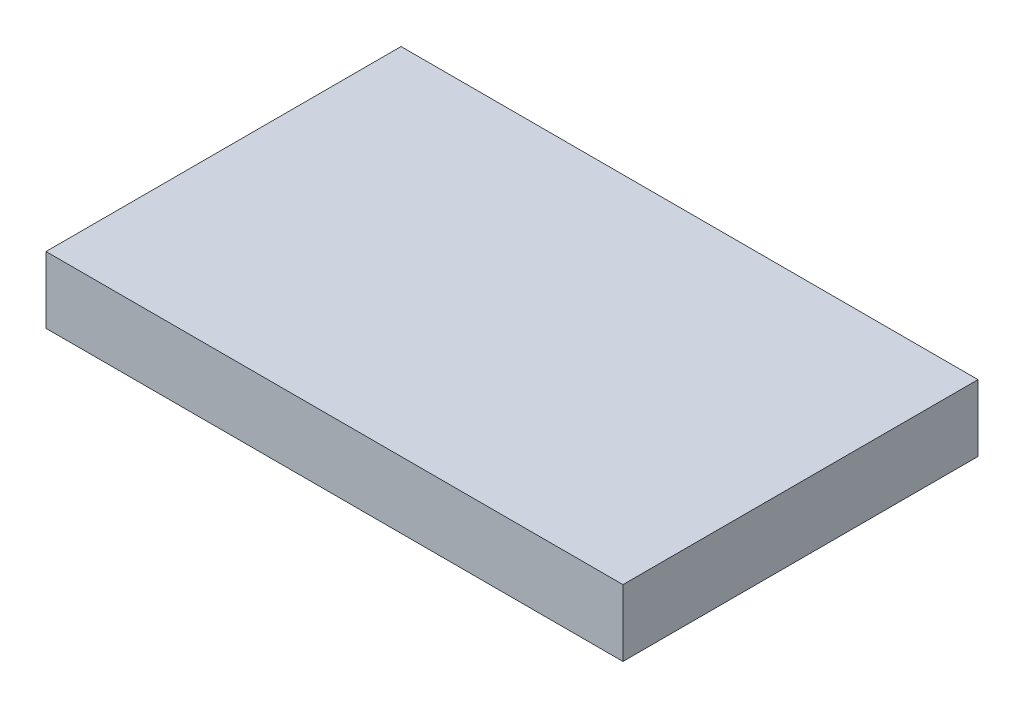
from build123d import *

# Parameters (mm, degrees)
SKETCH1_W      = 165.1
SKETCH1_H      = 19.05
EXTRUDE1_DEPTH = 101.6


with BuildPart() as part:
    # Sketch1 → Extrude1 (new body)
    with BuildSketch(Plane.XY):
        with Locations((82.55, 9.525)):
            Rectangle(SKETCH1_W, SKETCH1_H)
    extrude(amount=EXTRUDE1_DEPTH)


solid = part.part
